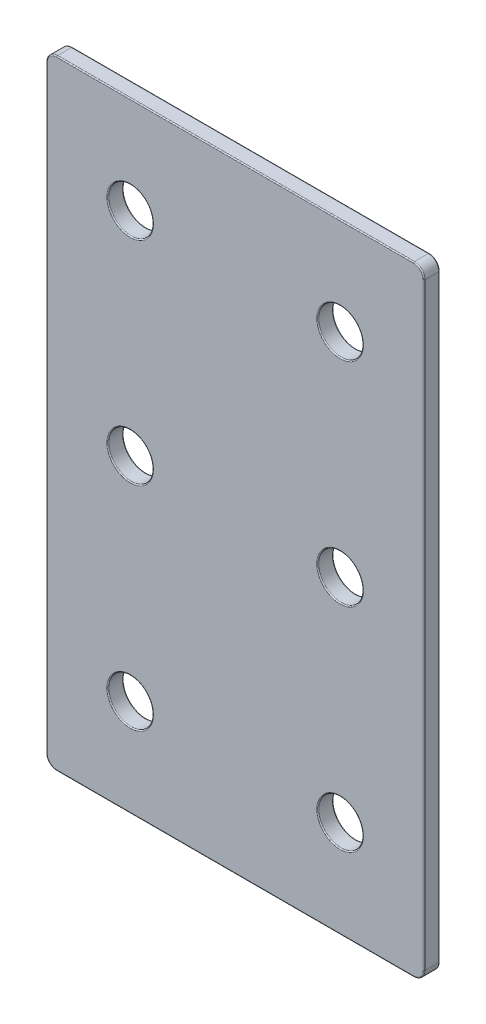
ISO-10303-21;
HEADER;
FILE_DESCRIPTION(('STEP AP214'),'2;1');
FILE_NAME('part.step','',(''),(''),'','','');
FILE_SCHEMA(('AUTOMOTIVE_DESIGN { 1 0 10303 214 1 1 1 1 }'));
ENDSEC;
DATA;
#1=APPLICATION_CONTEXT('core data for automotive mechanical design processes');
#2=APPLICATION_PROTOCOL_DEFINITION('international standard','automotive_design',2000,#1);
#3=PRODUCT_CONTEXT('',#1,'mechanical');
#4=PRODUCT('Part','Part','',(#3));
#5=PRODUCT_RELATED_PRODUCT_CATEGORY('part','',(#4));
#6=PRODUCT_DEFINITION_FORMATION('','',#4);
#7=PRODUCT_DEFINITION_CONTEXT('part definition',#1,'design');
#8=PRODUCT_DEFINITION('design','',#6,#7);
#9=PRODUCT_DEFINITION_SHAPE('','',#8);
#10=(LENGTH_UNIT() NAMED_UNIT(*) SI_UNIT(.MILLI.,.METRE.));
#11=(NAMED_UNIT(*) PLANE_ANGLE_UNIT() SI_UNIT($,.RADIAN.));
#12=(NAMED_UNIT(*) SI_UNIT($,.STERADIAN.) SOLID_ANGLE_UNIT());
#13=UNCERTAINTY_MEASURE_WITH_UNIT(LENGTH_MEASURE(1.E-05),#10,'distance_accuracy_value','');
#14=(GEOMETRIC_REPRESENTATION_CONTEXT(3) GLOBAL_UNCERTAINTY_ASSIGNED_CONTEXT((#13)) GLOBAL_UNIT_ASSIGNED_CONTEXT((#10,
#11,#12)) REPRESENTATION_CONTEXT('',''));
#15=CARTESIAN_POINT('',(0.,0.,0.));
#16=DIRECTION('',(0.,0.,1.));
#17=DIRECTION('',(1.,0.,0.));
#18=AXIS2_PLACEMENT_3D('',#15,#16,#17);
#19=CARTESIAN_POINT('',(36.,59.,1.5));
#20=DIRECTION('',(-1.,0.,0.));
#21=DIRECTION('',(0.,-1.,0.));
#22=AXIS2_PLACEMENT_3D('',#19,#20,#21);
#23=PLANE('',#22);
#24=DIRECTION('',(0.,0.,-1.));
#25=VECTOR('',#24,1.);
#26=CARTESIAN_POINT('',(36.,-57.,1.5));
#27=LINE('',#26,#25);
#28=CARTESIAN_POINT('',(36.,-57.,1.3));
#29=VERTEX_POINT('',#28);
#30=CARTESIAN_POINT('',(36.,-57.,-1.3));
#31=VERTEX_POINT('',#30);
#32=EDGE_CURVE('E336',#29,#31,#27,.T.);
#33=ORIENTED_EDGE('',*,*,#32,.T.);
#34=DIRECTION('',(0.,1.,0.));
#35=VECTOR('',#34,1.);
#36=CARTESIAN_POINT('',(36.,59.,-1.3));
#37=LINE('',#36,#35);
#38=CARTESIAN_POINT('',(36.,57.,-1.3));
#39=VERTEX_POINT('',#38);
#40=EDGE_CURVE('E187',#31,#39,#37,.T.);
#41=ORIENTED_EDGE('',*,*,#40,.T.);
#42=DIRECTION('',(0.,0.,-1.));
#43=VECTOR('',#42,1.);
#44=CARTESIAN_POINT('',(36.,57.,1.5));
#45=LINE('',#44,#43);
#46=CARTESIAN_POINT('',(36.,57.,1.3));
#47=VERTEX_POINT('',#46);
#48=EDGE_CURVE('E351',#39,#47,#45,.F.);
#49=ORIENTED_EDGE('',*,*,#48,.T.);
#50=DIRECTION('',(0.,1.,0.));
#51=VECTOR('',#50,1.);
#52=CARTESIAN_POINT('',(36.,-57.,1.3));
#53=LINE('',#52,#51);
#54=EDGE_CURVE('E185',#47,#29,#53,.F.);
#55=ORIENTED_EDGE('',*,*,#54,.T.);
#56=EDGE_LOOP('',(#33,#41,#49,#55));
#57=FACE_BOUND('',#56,.T.);
#58=ADVANCED_FACE('F37',(#57),#23,.F.);
#59=CARTESIAN_POINT('',(-36.,59.,1.5));
#60=DIRECTION('',(0.,-1.,0.));
#61=DIRECTION('',(0.,0.,-1.));
#62=AXIS2_PLACEMENT_3D('',#59,#60,#61);
#63=PLANE('',#62);
#64=DIRECTION('',(0.,0.,-1.));
#65=VECTOR('',#64,1.);
#66=CARTESIAN_POINT('',(34.,59.,1.5));
#67=LINE('',#66,#65);
#68=CARTESIAN_POINT('',(34.,59.,1.3));
#69=VERTEX_POINT('',#68);
#70=CARTESIAN_POINT('',(34.,59.,-1.3));
#71=VERTEX_POINT('',#70);
#72=EDGE_CURVE('E355',#69,#71,#67,.T.);
#73=ORIENTED_EDGE('',*,*,#72,.T.);
#74=DIRECTION('',(-1.,0.,0.));
#75=VECTOR('',#74,1.);
#76=CARTESIAN_POINT('',(-36.,59.,-1.3));
#77=LINE('',#76,#75);
#78=CARTESIAN_POINT('',(-34.,59.,-1.3));
#79=VERTEX_POINT('',#78);
#80=EDGE_CURVE('E195',#71,#79,#77,.T.);
#81=ORIENTED_EDGE('',*,*,#80,.T.);
#82=DIRECTION('',(0.,0.,-1.));
#83=VECTOR('',#82,1.);
#84=CARTESIAN_POINT('',(-34.,59.,1.5));
#85=LINE('',#84,#83);
#86=CARTESIAN_POINT('',(-34.,59.,1.3));
#87=VERTEX_POINT('',#86);
#88=EDGE_CURVE('E358',#79,#87,#85,.F.);
#89=ORIENTED_EDGE('',*,*,#88,.T.);
#90=DIRECTION('',(-1.,0.,0.));
#91=VECTOR('',#90,1.);
#92=CARTESIAN_POINT('',(34.,59.,1.3));
#93=LINE('',#92,#91);
#94=EDGE_CURVE('E193',#87,#69,#93,.F.);
#95=ORIENTED_EDGE('',*,*,#94,.T.);
#96=EDGE_LOOP('',(#73,#81,#89,#95));
#97=FACE_BOUND('',#96,.T.);
#98=ADVANCED_FACE('F440',(#97),#63,.F.);
#99=CARTESIAN_POINT('',(-36.,59.,1.5));
#100=DIRECTION('',(1.,0.,0.));
#101=DIRECTION('',(0.,1.,0.));
#102=AXIS2_PLACEMENT_3D('',#99,#100,#101);
#103=PLANE('',#102);
#104=DIRECTION('',(0.,0.,-1.));
#105=VECTOR('',#104,1.);
#106=CARTESIAN_POINT('',(-36.,57.,1.5));
#107=LINE('',#106,#105);
#108=CARTESIAN_POINT('',(-36.,57.,1.3));
#109=VERTEX_POINT('',#108);
#110=CARTESIAN_POINT('',(-36.,57.,-1.3));
#111=VERTEX_POINT('',#110);
#112=EDGE_CURVE('E343',#109,#111,#107,.T.);
#113=ORIENTED_EDGE('',*,*,#112,.T.);
#114=DIRECTION('',(0.,-1.,0.));
#115=VECTOR('',#114,1.);
#116=CARTESIAN_POINT('',(-36.,59.,-1.3));
#117=LINE('',#116,#115);
#118=CARTESIAN_POINT('',(-36.,-57.,-1.3));
#119=VERTEX_POINT('',#118);
#120=EDGE_CURVE('E204',#111,#119,#117,.T.);
#121=ORIENTED_EDGE('',*,*,#120,.T.);
#122=DIRECTION('',(0.,0.,-1.));
#123=VECTOR('',#122,1.);
#124=CARTESIAN_POINT('',(-36.,-57.,1.5));
#125=LINE('',#124,#123);
#126=CARTESIAN_POINT('',(-36.,-57.,1.3));
#127=VERTEX_POINT('',#126);
#128=EDGE_CURVE('E348',#119,#127,#125,.F.);
#129=ORIENTED_EDGE('',*,*,#128,.T.);
#130=DIRECTION('',(0.,-1.,0.));
#131=VECTOR('',#130,1.);
#132=CARTESIAN_POINT('',(-36.,57.,1.3));
#133=LINE('',#132,#131);
#134=EDGE_CURVE('E202',#127,#109,#133,.F.);
#135=ORIENTED_EDGE('',*,*,#134,.T.);
#136=EDGE_LOOP('',(#113,#121,#129,#135));
#137=FACE_BOUND('',#136,.T.);
#138=ADVANCED_FACE('F424',(#137),#103,.F.);
#139=CARTESIAN_POINT('',(-36.,-59.,1.5));
#140=DIRECTION('',(0.,1.,0.));
#141=DIRECTION('',(0.,0.,1.));
#142=AXIS2_PLACEMENT_3D('',#139,#140,#141);
#143=PLANE('',#142);
#144=DIRECTION('',(0.,0.,-1.));
#145=VECTOR('',#144,1.);
#146=CARTESIAN_POINT('',(-34.,-59.,1.5));
#147=LINE('',#146,#145);
#148=CARTESIAN_POINT('',(-34.,-59.,1.3));
#149=VERTEX_POINT('',#148);
#150=CARTESIAN_POINT('',(-34.,-59.,-1.3));
#151=VERTEX_POINT('',#150);
#152=EDGE_CURVE('E341',#149,#151,#147,.T.);
#153=ORIENTED_EDGE('',*,*,#152,.T.);
#154=DIRECTION('',(1.,0.,0.));
#155=VECTOR('',#154,1.);
#156=CARTESIAN_POINT('',(-36.,-59.,-1.3));
#157=LINE('',#156,#155);
#158=CARTESIAN_POINT('',(34.,-59.,-1.3));
#159=VERTEX_POINT('',#158);
#160=EDGE_CURVE('E212',#151,#159,#157,.T.);
#161=ORIENTED_EDGE('',*,*,#160,.T.);
#162=DIRECTION('',(0.,0.,-1.));
#163=VECTOR('',#162,1.);
#164=CARTESIAN_POINT('',(34.,-59.,1.5));
#165=LINE('',#164,#163);
#166=CARTESIAN_POINT('',(34.,-59.,1.3));
#167=VERTEX_POINT('',#166);
#168=EDGE_CURVE('E297',#159,#167,#165,.F.);
#169=ORIENTED_EDGE('',*,*,#168,.T.);
#170=DIRECTION('',(1.,0.,0.));
#171=VECTOR('',#170,1.);
#172=CARTESIAN_POINT('',(-34.,-59.,1.3));
#173=LINE('',#172,#171);
#174=EDGE_CURVE('E210',#167,#149,#173,.F.);
#175=ORIENTED_EDGE('',*,*,#174,.T.);
#176=EDGE_LOOP('',(#153,#161,#169,#175));
#177=FACE_BOUND('',#176,.T.);
#178=ADVANCED_FACE('F339',(#177),#143,.F.);
#179=CARTESIAN_POINT('',(0.,0.,1.5));
#180=DIRECTION('',(0.,0.,1.));
#181=DIRECTION('',(1.,0.,0.));
#182=AXIS2_PLACEMENT_3D('',#179,#180,#181);
#183=PLANE('',#182);
#184=DIRECTION('',(-1.,0.,0.));
#185=VECTOR('',#184,1.);
#186=CARTESIAN_POINT('',(-34.,58.8,1.5));
#187=LINE('',#186,#185);
#188=CARTESIAN_POINT('',(34.,58.8,1.5));
#189=VERTEX_POINT('',#188);
#190=CARTESIAN_POINT('',(-34.,58.8,1.5));
#191=VERTEX_POINT('',#190);
#192=EDGE_CURVE('E46',#189,#191,#187,.T.);
#193=ORIENTED_EDGE('',*,*,#192,.T.);
#194=CARTESIAN_POINT('',(-34.,57.,1.5));
#195=DIRECTION('',(0.,0.,1.));
#196=DIRECTION('',(1.,0.,0.));
#197=AXIS2_PLACEMENT_3D('',#194,#195,#196);
#198=CIRCLE('',#197,1.8);
#199=CARTESIAN_POINT('',(-35.8,57.,1.5));
#200=VERTEX_POINT('',#199);
#201=EDGE_CURVE('E11',#191,#200,#198,.T.);
#202=ORIENTED_EDGE('',*,*,#201,.T.);
#203=DIRECTION('',(0.,-1.,0.));
#204=VECTOR('',#203,1.);
#205=CARTESIAN_POINT('',(-35.8,-57.,1.5));
#206=LINE('',#205,#204);
#207=CARTESIAN_POINT('',(-35.8,-57.,1.5));
#208=VERTEX_POINT('',#207);
#209=EDGE_CURVE('E268',#200,#208,#206,.T.);
#210=ORIENTED_EDGE('',*,*,#209,.T.);
#211=CARTESIAN_POINT('',(-34.,-57.,1.5));
#212=DIRECTION('',(0.,0.,1.));
#213=DIRECTION('',(1.,0.,0.));
#214=AXIS2_PLACEMENT_3D('',#211,#212,#213);
#215=CIRCLE('',#214,1.8);
#216=CARTESIAN_POINT('',(-34.,-58.8,1.5));
#217=VERTEX_POINT('',#216);
#218=EDGE_CURVE('E270',#208,#217,#215,.T.);
#219=ORIENTED_EDGE('',*,*,#218,.T.);
#220=DIRECTION('',(1.,0.,0.));
#221=VECTOR('',#220,1.);
#222=CARTESIAN_POINT('',(34.,-58.8,1.5));
#223=LINE('',#222,#221);
#224=CARTESIAN_POINT('',(34.,-58.8,1.5));
#225=VERTEX_POINT('',#224);
#226=EDGE_CURVE('E272',#217,#225,#223,.T.);
#227=ORIENTED_EDGE('',*,*,#226,.T.);
#228=CARTESIAN_POINT('',(34.,-57.,1.5));
#229=DIRECTION('',(0.,0.,1.));
#230=DIRECTION('',(1.,0.,0.));
#231=AXIS2_PLACEMENT_3D('',#228,#229,#230);
#232=CIRCLE('',#231,1.8);
#233=CARTESIAN_POINT('',(35.8,-57.,1.5));
#234=VERTEX_POINT('',#233);
#235=EDGE_CURVE('E274',#225,#234,#232,.T.);
#236=ORIENTED_EDGE('',*,*,#235,.T.);
#237=DIRECTION('',(0.,1.,0.));
#238=VECTOR('',#237,1.);
#239=CARTESIAN_POINT('',(35.8,57.,1.5));
#240=LINE('',#239,#238);
#241=CARTESIAN_POINT('',(35.8,57.,1.5));
#242=VERTEX_POINT('',#241);
#243=EDGE_CURVE('E276',#234,#242,#240,.T.);
#244=ORIENTED_EDGE('',*,*,#243,.T.);
#245=CARTESIAN_POINT('',(34.,57.,1.5));
#246=DIRECTION('',(0.,0.,1.));
#247=DIRECTION('',(1.,0.,0.));
#248=AXIS2_PLACEMENT_3D('',#245,#246,#247);
#249=CIRCLE('',#248,1.8);
#250=EDGE_CURVE('E57',#242,#189,#249,.T.);
#251=ORIENTED_EDGE('',*,*,#250,.T.);
#252=EDGE_LOOP('',(#193,#202,#210,#219,#227,#236,#244,#251));
#253=FACE_BOUND('',#252,.T.);
#254=CARTESIAN_POINT('',(20.,0.,1.5));
#255=DIRECTION('',(0.,0.,1.));
#256=DIRECTION('',(1.,0.,0.));
#257=AXIS2_PLACEMENT_3D('',#254,#255,#256);
#258=CIRCLE('',#257,4.45);
#259=CARTESIAN_POINT('',(24.45,0.,1.5));
#260=VERTEX_POINT('',#259);
#261=EDGE_CURVE('E265',#260,#260,#258,.F.);
#262=ORIENTED_EDGE('',*,*,#261,.T.);
#263=EDGE_LOOP('',(#262));
#264=FACE_BOUND('',#263,.T.);
#265=CARTESIAN_POINT('',(20.,40.5,1.5));
#266=DIRECTION('',(0.,0.,1.));
#267=DIRECTION('',(1.,0.,0.));
#268=AXIS2_PLACEMENT_3D('',#265,#266,#267);
#269=CIRCLE('',#268,4.45);
#270=CARTESIAN_POINT('',(24.45,40.5,1.5));
#271=VERTEX_POINT('',#270);
#272=EDGE_CURVE('E262',#271,#271,#269,.F.);
#273=ORIENTED_EDGE('',*,*,#272,.T.);
#274=EDGE_LOOP('',(#273));
#275=FACE_BOUND('',#274,.T.);
#276=CARTESIAN_POINT('',(20.,-40.5,1.5));
#277=DIRECTION('',(0.,0.,1.));
#278=DIRECTION('',(1.,0.,0.));
#279=AXIS2_PLACEMENT_3D('',#276,#277,#278);
#280=CIRCLE('',#279,4.45);
#281=CARTESIAN_POINT('',(24.45,-40.5,1.5));
#282=VERTEX_POINT('',#281);
#283=EDGE_CURVE('E259',#282,#282,#280,.F.);
#284=ORIENTED_EDGE('',*,*,#283,.T.);
#285=EDGE_LOOP('',(#284));
#286=FACE_BOUND('',#285,.T.);
#287=CARTESIAN_POINT('',(-20.,-40.5,1.5));
#288=DIRECTION('',(0.,0.,1.));
#289=DIRECTION('',(1.,0.,0.));
#290=AXIS2_PLACEMENT_3D('',#287,#288,#289);
#291=CIRCLE('',#290,4.45);
#292=CARTESIAN_POINT('',(-15.55,-40.5,1.5));
#293=VERTEX_POINT('',#292);
#294=EDGE_CURVE('E256',#293,#293,#291,.F.);
#295=ORIENTED_EDGE('',*,*,#294,.T.);
#296=EDGE_LOOP('',(#295));
#297=FACE_BOUND('',#296,.T.);
#298=CARTESIAN_POINT('',(-20.,0.,1.5));
#299=DIRECTION('',(0.,0.,1.));
#300=DIRECTION('',(1.,0.,0.));
#301=AXIS2_PLACEMENT_3D('',#298,#299,#300);
#302=CIRCLE('',#301,4.45);
#303=CARTESIAN_POINT('',(-15.55,0.,1.5));
#304=VERTEX_POINT('',#303);
#305=EDGE_CURVE('E253',#304,#304,#302,.F.);
#306=ORIENTED_EDGE('',*,*,#305,.T.);
#307=EDGE_LOOP('',(#306));
#308=FACE_BOUND('',#307,.T.);
#309=CARTESIAN_POINT('',(-20.,40.5,1.5));
#310=DIRECTION('',(0.,0.,1.));
#311=DIRECTION('',(1.,0.,0.));
#312=AXIS2_PLACEMENT_3D('',#309,#310,#311);
#313=CIRCLE('',#312,4.45);
#314=CARTESIAN_POINT('',(-15.55,40.5,1.5));
#315=VERTEX_POINT('',#314);
#316=EDGE_CURVE('E250',#315,#315,#313,.F.);
#317=ORIENTED_EDGE('',*,*,#316,.T.);
#318=EDGE_LOOP('',(#317));
#319=FACE_BOUND('',#318,.T.);
#320=ADVANCED_FACE('F411',(#253,#264,#275,#286,#297,#308,#319),#183,.T.);
#321=CARTESIAN_POINT('',(0.,0.,-1.5));
#322=DIRECTION('',(0.,0.,1.));
#323=DIRECTION('',(1.,0.,0.));
#324=AXIS2_PLACEMENT_3D('',#321,#322,#323);
#325=PLANE('',#324);
#326=DIRECTION('',(0.,1.,0.));
#327=VECTOR('',#326,1.);
#328=CARTESIAN_POINT('',(35.8,0.,-1.5));
#329=LINE('',#328,#327);
#330=CARTESIAN_POINT('',(35.8,57.,-1.5));
#331=VERTEX_POINT('',#330);
#332=CARTESIAN_POINT('',(35.8,-57.,-1.5));
#333=VERTEX_POINT('',#332);
#334=EDGE_CURVE('E175',#331,#333,#329,.F.);
#335=ORIENTED_EDGE('',*,*,#334,.T.);
#336=CARTESIAN_POINT('',(34.,-57.,-1.5));
#337=DIRECTION('',(0.,0.,1.));
#338=DIRECTION('',(1.,0.,0.));
#339=AXIS2_PLACEMENT_3D('',#336,#337,#338);
#340=CIRCLE('',#339,1.8);
#341=CARTESIAN_POINT('',(34.,-58.8,-1.5));
#342=VERTEX_POINT('',#341);
#343=EDGE_CURVE('E155',#333,#342,#340,.F.);
#344=ORIENTED_EDGE('',*,*,#343,.T.);
#345=DIRECTION('',(1.,0.,0.));
#346=VECTOR('',#345,1.);
#347=CARTESIAN_POINT('',(0.,-58.8,-1.5));
#348=LINE('',#347,#346);
#349=CARTESIAN_POINT('',(-34.,-58.8,-1.5));
#350=VERTEX_POINT('',#349);
#351=EDGE_CURVE('E163',#342,#350,#348,.F.);
#352=ORIENTED_EDGE('',*,*,#351,.T.);
#353=CARTESIAN_POINT('',(-34.,-57.,-1.5));
#354=DIRECTION('',(0.,0.,1.));
#355=DIRECTION('',(1.,0.,0.));
#356=AXIS2_PLACEMENT_3D('',#353,#354,#355);
#357=CIRCLE('',#356,1.8);
#358=CARTESIAN_POINT('',(-35.8,-57.,-1.5));
#359=VERTEX_POINT('',#358);
#360=EDGE_CURVE('E169',#350,#359,#357,.F.);
#361=ORIENTED_EDGE('',*,*,#360,.T.);
#362=DIRECTION('',(0.,-1.,0.));
#363=VECTOR('',#362,1.);
#364=CARTESIAN_POINT('',(-35.8,0.,-1.5));
#365=LINE('',#364,#363);
#366=CARTESIAN_POINT('',(-35.8,57.,-1.5));
#367=VERTEX_POINT('',#366);
#368=EDGE_CURVE('E379',#359,#367,#365,.F.);
#369=ORIENTED_EDGE('',*,*,#368,.T.);
#370=CARTESIAN_POINT('',(-34.,57.,-1.5));
#371=DIRECTION('',(0.,0.,1.));
#372=DIRECTION('',(1.,0.,0.));
#373=AXIS2_PLACEMENT_3D('',#370,#371,#372);
#374=CIRCLE('',#373,1.8);
#375=CARTESIAN_POINT('',(-34.,58.8,-1.5));
#376=VERTEX_POINT('',#375);
#377=EDGE_CURVE('E381',#367,#376,#374,.F.);
#378=ORIENTED_EDGE('',*,*,#377,.T.);
#379=DIRECTION('',(-1.,0.,0.));
#380=VECTOR('',#379,1.);
#381=CARTESIAN_POINT('',(0.,58.8,-1.5));
#382=LINE('',#381,#380);
#383=CARTESIAN_POINT('',(34.,58.8,-1.5));
#384=VERTEX_POINT('',#383);
#385=EDGE_CURVE('E383',#376,#384,#382,.F.);
#386=ORIENTED_EDGE('',*,*,#385,.T.);
#387=CARTESIAN_POINT('',(34.,57.,-1.5));
#388=DIRECTION('',(0.,0.,1.));
#389=DIRECTION('',(1.,0.,0.));
#390=AXIS2_PLACEMENT_3D('',#387,#388,#389);
#391=CIRCLE('',#390,1.8);
#392=EDGE_CURVE('E180',#384,#331,#391,.F.);
#393=ORIENTED_EDGE('',*,*,#392,.T.);
#394=EDGE_LOOP('',(#335,#344,#352,#361,#369,#378,#386,#393));
#395=FACE_BOUND('',#394,.T.);
#396=CARTESIAN_POINT('',(20.,0.,-1.5));
#397=DIRECTION('',(0.,0.,1.));
#398=DIRECTION('',(1.,0.,0.));
#399=AXIS2_PLACEMENT_3D('',#396,#397,#398);
#400=CIRCLE('',#399,4.45);
#401=CARTESIAN_POINT('',(24.45,0.,-1.5));
#402=VERTEX_POINT('',#401);
#403=EDGE_CURVE('E170',#402,#402,#400,.T.);
#404=ORIENTED_EDGE('',*,*,#403,.T.);
#405=EDGE_LOOP('',(#404));
#406=FACE_BOUND('',#405,.T.);
#407=CARTESIAN_POINT('',(20.,40.5,-1.5));
#408=DIRECTION('',(0.,0.,1.));
#409=DIRECTION('',(1.,0.,0.));
#410=AXIS2_PLACEMENT_3D('',#407,#408,#409);
#411=CIRCLE('',#410,4.45);
#412=CARTESIAN_POINT('',(24.45,40.5,-1.5));
#413=VERTEX_POINT('',#412);
#414=EDGE_CURVE('E373',#413,#413,#411,.T.);
#415=ORIENTED_EDGE('',*,*,#414,.T.);
#416=EDGE_LOOP('',(#415));
#417=FACE_BOUND('',#416,.T.);
#418=CARTESIAN_POINT('',(20.,-40.5,-1.5));
#419=DIRECTION('',(0.,0.,1.));
#420=DIRECTION('',(1.,0.,0.));
#421=AXIS2_PLACEMENT_3D('',#418,#419,#420);
#422=CIRCLE('',#421,4.45);
#423=CARTESIAN_POINT('',(24.45,-40.5,-1.5));
#424=VERTEX_POINT('',#423);
#425=EDGE_CURVE('E370',#424,#424,#422,.T.);
#426=ORIENTED_EDGE('',*,*,#425,.T.);
#427=EDGE_LOOP('',(#426));
#428=FACE_BOUND('',#427,.T.);
#429=CARTESIAN_POINT('',(-20.,-40.5,-1.5));
#430=DIRECTION('',(0.,0.,1.));
#431=DIRECTION('',(1.,0.,0.));
#432=AXIS2_PLACEMENT_3D('',#429,#430,#431);
#433=CIRCLE('',#432,4.45);
#434=CARTESIAN_POINT('',(-15.55,-40.5,-1.5));
#435=VERTEX_POINT('',#434);
#436=EDGE_CURVE('E367',#435,#435,#433,.T.);
#437=ORIENTED_EDGE('',*,*,#436,.T.);
#438=EDGE_LOOP('',(#437));
#439=FACE_BOUND('',#438,.T.);
#440=CARTESIAN_POINT('',(-20.,0.,-1.5));
#441=DIRECTION('',(0.,0.,1.));
#442=DIRECTION('',(1.,0.,0.));
#443=AXIS2_PLACEMENT_3D('',#440,#441,#442);
#444=CIRCLE('',#443,4.45);
#445=CARTESIAN_POINT('',(-15.55,0.,-1.5));
#446=VERTEX_POINT('',#445);
#447=EDGE_CURVE('E364',#446,#446,#444,.T.);
#448=ORIENTED_EDGE('',*,*,#447,.T.);
#449=EDGE_LOOP('',(#448));
#450=FACE_BOUND('',#449,.T.);
#451=CARTESIAN_POINT('',(-20.,40.5,-1.5));
#452=DIRECTION('',(0.,0.,1.));
#453=DIRECTION('',(1.,0.,0.));
#454=AXIS2_PLACEMENT_3D('',#451,#452,#453);
#455=CIRCLE('',#454,4.45);
#456=CARTESIAN_POINT('',(-15.55,40.5,-1.5));
#457=VERTEX_POINT('',#456);
#458=EDGE_CURVE('E361',#457,#457,#455,.T.);
#459=ORIENTED_EDGE('',*,*,#458,.T.);
#460=EDGE_LOOP('',(#459));
#461=FACE_BOUND('',#460,.T.);
#462=ADVANCED_FACE('F172',(#395,#406,#417,#428,#439,#450,#461),#325,.F.);
#463=CARTESIAN_POINT('',(20.,0.,-1.5));
#464=DIRECTION('',(0.,0.,1.));
#465=DIRECTION('',(1.,0.,0.));
#466=AXIS2_PLACEMENT_3D('',#463,#464,#465);
#467=CYLINDRICAL_SURFACE('',#466,4.25);
#468=CARTESIAN_POINT('',(20.,0.,-1.3));
#469=DIRECTION('',(0.,0.,1.));
#470=DIRECTION('',(1.,0.,0.));
#471=AXIS2_PLACEMENT_3D('',#468,#469,#470);
#472=CIRCLE('',#471,4.25);
#473=CARTESIAN_POINT('',(24.25,0.,-1.3));
#474=VERTEX_POINT('',#473);
#475=EDGE_CURVE('E217',#474,#474,#472,.F.);
#476=ORIENTED_EDGE('',*,*,#475,.T.);
#477=EDGE_LOOP('',(#476));
#478=FACE_BOUND('',#477,.T.);
#479=CARTESIAN_POINT('',(20.,0.,1.3));
#480=DIRECTION('',(0.,0.,1.));
#481=DIRECTION('',(1.,0.,0.));
#482=AXIS2_PLACEMENT_3D('',#479,#480,#481);
#483=CIRCLE('',#482,4.25);
#484=CARTESIAN_POINT('',(24.25,0.,1.3));
#485=VERTEX_POINT('',#484);
#486=EDGE_CURVE('E214',#485,#485,#483,.T.);
#487=ORIENTED_EDGE('',*,*,#486,.T.);
#488=EDGE_LOOP('',(#487));
#489=FACE_BOUND('',#488,.T.);
#490=ADVANCED_FACE('F570',(#478,#489),#467,.F.);
#491=CARTESIAN_POINT('',(20.,40.5,-1.5));
#492=DIRECTION('',(0.,0.,1.));
#493=DIRECTION('',(1.,0.,0.));
#494=AXIS2_PLACEMENT_3D('',#491,#492,#493);
#495=CYLINDRICAL_SURFACE('',#494,4.25);
#496=CARTESIAN_POINT('',(20.,40.5,-1.3));
#497=DIRECTION('',(0.,0.,1.));
#498=DIRECTION('',(1.,0.,0.));
#499=AXIS2_PLACEMENT_3D('',#496,#497,#498);
#500=CIRCLE('',#499,4.25);
#501=CARTESIAN_POINT('',(24.25,40.5,-1.3));
#502=VERTEX_POINT('',#501);
#503=EDGE_CURVE('E223',#502,#502,#500,.F.);
#504=ORIENTED_EDGE('',*,*,#503,.T.);
#505=EDGE_LOOP('',(#504));
#506=FACE_BOUND('',#505,.T.);
#507=CARTESIAN_POINT('',(20.,40.5,1.3));
#508=DIRECTION('',(0.,0.,1.));
#509=DIRECTION('',(1.,0.,0.));
#510=AXIS2_PLACEMENT_3D('',#507,#508,#509);
#511=CIRCLE('',#510,4.25);
#512=CARTESIAN_POINT('',(24.25,40.5,1.3));
#513=VERTEX_POINT('',#512);
#514=EDGE_CURVE('E220',#513,#513,#511,.T.);
#515=ORIENTED_EDGE('',*,*,#514,.T.);
#516=EDGE_LOOP('',(#515));
#517=FACE_BOUND('',#516,.T.);
#518=ADVANCED_FACE('F566',(#506,#517),#495,.F.);
#519=CARTESIAN_POINT('',(20.,-40.5,-1.5));
#520=DIRECTION('',(0.,0.,1.));
#521=DIRECTION('',(1.,0.,0.));
#522=AXIS2_PLACEMENT_3D('',#519,#520,#521);
#523=CYLINDRICAL_SURFACE('',#522,4.25);
#524=CARTESIAN_POINT('',(20.,-40.5,-1.3));
#525=DIRECTION('',(0.,0.,1.));
#526=DIRECTION('',(1.,0.,0.));
#527=AXIS2_PLACEMENT_3D('',#524,#525,#526);
#528=CIRCLE('',#527,4.25);
#529=CARTESIAN_POINT('',(24.25,-40.5,-1.3));
#530=VERTEX_POINT('',#529);
#531=EDGE_CURVE('E229',#530,#530,#528,.F.);
#532=ORIENTED_EDGE('',*,*,#531,.T.);
#533=EDGE_LOOP('',(#532));
#534=FACE_BOUND('',#533,.T.);
#535=CARTESIAN_POINT('',(20.,-40.5,1.3));
#536=DIRECTION('',(0.,0.,1.));
#537=DIRECTION('',(1.,0.,0.));
#538=AXIS2_PLACEMENT_3D('',#535,#536,#537);
#539=CIRCLE('',#538,4.25);
#540=CARTESIAN_POINT('',(24.25,-40.5,1.3));
#541=VERTEX_POINT('',#540);
#542=EDGE_CURVE('E226',#541,#541,#539,.T.);
#543=ORIENTED_EDGE('',*,*,#542,.T.);
#544=EDGE_LOOP('',(#543));
#545=FACE_BOUND('',#544,.T.);
#546=ADVANCED_FACE('F560',(#534,#545),#523,.F.);
#547=CARTESIAN_POINT('',(-20.,-40.5,-1.5));
#548=DIRECTION('',(0.,0.,1.));
#549=DIRECTION('',(1.,0.,0.));
#550=AXIS2_PLACEMENT_3D('',#547,#548,#549);
#551=CYLINDRICAL_SURFACE('',#550,4.25);
#552=CARTESIAN_POINT('',(-20.,-40.5,-1.3));
#553=DIRECTION('',(0.,0.,1.));
#554=DIRECTION('',(1.,0.,0.));
#555=AXIS2_PLACEMENT_3D('',#552,#553,#554);
#556=CIRCLE('',#555,4.25);
#557=CARTESIAN_POINT('',(-15.75,-40.5,-1.3));
#558=VERTEX_POINT('',#557);
#559=EDGE_CURVE('E235',#558,#558,#556,.F.);
#560=ORIENTED_EDGE('',*,*,#559,.T.);
#561=EDGE_LOOP('',(#560));
#562=FACE_BOUND('',#561,.T.);
#563=CARTESIAN_POINT('',(-20.,-40.5,1.3));
#564=DIRECTION('',(0.,0.,1.));
#565=DIRECTION('',(1.,0.,0.));
#566=AXIS2_PLACEMENT_3D('',#563,#564,#565);
#567=CIRCLE('',#566,4.25);
#568=CARTESIAN_POINT('',(-15.75,-40.5,1.3));
#569=VERTEX_POINT('',#568);
#570=EDGE_CURVE('E232',#569,#569,#567,.T.);
#571=ORIENTED_EDGE('',*,*,#570,.T.);
#572=EDGE_LOOP('',(#571));
#573=FACE_BOUND('',#572,.T.);
#574=ADVANCED_FACE('F551',(#562,#573),#551,.F.);
#575=CARTESIAN_POINT('',(-20.,0.,-1.5));
#576=DIRECTION('',(0.,0.,1.));
#577=DIRECTION('',(1.,0.,0.));
#578=AXIS2_PLACEMENT_3D('',#575,#576,#577);
#579=CYLINDRICAL_SURFACE('',#578,4.25);
#580=CARTESIAN_POINT('',(-20.,0.,-1.3));
#581=DIRECTION('',(0.,0.,1.));
#582=DIRECTION('',(1.,0.,0.));
#583=AXIS2_PLACEMENT_3D('',#580,#581,#582);
#584=CIRCLE('',#583,4.25);
#585=CARTESIAN_POINT('',(-15.75,0.,-1.3));
#586=VERTEX_POINT('',#585);
#587=EDGE_CURVE('E241',#586,#586,#584,.F.);
#588=ORIENTED_EDGE('',*,*,#587,.T.);
#589=EDGE_LOOP('',(#588));
#590=FACE_BOUND('',#589,.T.);
#591=CARTESIAN_POINT('',(-20.,0.,1.3));
#592=DIRECTION('',(0.,0.,1.));
#593=DIRECTION('',(1.,0.,0.));
#594=AXIS2_PLACEMENT_3D('',#591,#592,#593);
#595=CIRCLE('',#594,4.25);
#596=CARTESIAN_POINT('',(-15.75,0.,1.3));
#597=VERTEX_POINT('',#596);
#598=EDGE_CURVE('E238',#597,#597,#595,.T.);
#599=ORIENTED_EDGE('',*,*,#598,.T.);
#600=EDGE_LOOP('',(#599));
#601=FACE_BOUND('',#600,.T.);
#602=ADVANCED_FACE('F549',(#590,#601),#579,.F.);
#603=CARTESIAN_POINT('',(-20.,40.5,-1.5));
#604=DIRECTION('',(0.,0.,1.));
#605=DIRECTION('',(1.,0.,0.));
#606=AXIS2_PLACEMENT_3D('',#603,#604,#605);
#607=CYLINDRICAL_SURFACE('',#606,4.25);
#608=CARTESIAN_POINT('',(-20.,40.5,-1.3));
#609=DIRECTION('',(0.,0.,1.));
#610=DIRECTION('',(1.,0.,0.));
#611=AXIS2_PLACEMENT_3D('',#608,#609,#610);
#612=CIRCLE('',#611,4.25);
#613=CARTESIAN_POINT('',(-15.75,40.5,-1.3));
#614=VERTEX_POINT('',#613);
#615=EDGE_CURVE('E247',#614,#614,#612,.F.);
#616=ORIENTED_EDGE('',*,*,#615,.T.);
#617=EDGE_LOOP('',(#616));
#618=FACE_BOUND('',#617,.T.);
#619=CARTESIAN_POINT('',(-20.,40.5,1.3));
#620=DIRECTION('',(0.,0.,1.));
#621=DIRECTION('',(1.,0.,0.));
#622=AXIS2_PLACEMENT_3D('',#619,#620,#621);
#623=CIRCLE('',#622,4.25);
#624=CARTESIAN_POINT('',(-15.75,40.5,1.3));
#625=VERTEX_POINT('',#624);
#626=EDGE_CURVE('E244',#625,#625,#623,.T.);
#627=ORIENTED_EDGE('',*,*,#626,.T.);
#628=EDGE_LOOP('',(#627));
#629=FACE_BOUND('',#628,.T.);
#630=ADVANCED_FACE('F454',(#618,#629),#607,.F.);
#631=CARTESIAN_POINT('',(-34.,-57.,1.5));
#632=DIRECTION('',(0.,0.,-1.));
#633=DIRECTION('',(-1.,0.,0.));
#634=AXIS2_PLACEMENT_3D('',#631,#632,#633);
#635=CYLINDRICAL_SURFACE('',#634,2.);
#636=ORIENTED_EDGE('',*,*,#128,.F.);
#637=CARTESIAN_POINT('',(-34.,-57.,-1.3));
#638=DIRECTION('',(0.,0.,1.));
#639=DIRECTION('',(1.,0.,0.));
#640=AXIS2_PLACEMENT_3D('',#637,#638,#639);
#641=CIRCLE('',#640,2.);
#642=EDGE_CURVE('E208',#119,#151,#641,.T.);
#643=ORIENTED_EDGE('',*,*,#642,.T.);
#644=ORIENTED_EDGE('',*,*,#152,.F.);
#645=CARTESIAN_POINT('',(-34.,-57.,1.3));
#646=DIRECTION('',(0.,0.,1.));
#647=DIRECTION('',(1.,0.,0.));
#648=AXIS2_PLACEMENT_3D('',#645,#646,#647);
#649=CIRCLE('',#648,2.);
#650=EDGE_CURVE('E206',#149,#127,#649,.F.);
#651=ORIENTED_EDGE('',*,*,#650,.T.);
#652=EDGE_LOOP('',(#636,#643,#644,#651));
#653=FACE_BOUND('',#652,.T.);
#654=ADVANCED_FACE('F451',(#653),#635,.T.);
#655=CARTESIAN_POINT('',(34.,-57.,1.5));
#656=DIRECTION('',(0.,0.,-1.));
#657=DIRECTION('',(-1.,0.,0.));
#658=AXIS2_PLACEMENT_3D('',#655,#656,#657);
#659=CYLINDRICAL_SURFACE('',#658,2.);
#660=ORIENTED_EDGE('',*,*,#168,.F.);
#661=CARTESIAN_POINT('',(34.,-57.,-1.3));
#662=DIRECTION('',(0.,0.,1.));
#663=DIRECTION('',(1.,0.,0.));
#664=AXIS2_PLACEMENT_3D('',#661,#662,#663);
#665=CIRCLE('',#664,2.);
#666=EDGE_CURVE('E157',#159,#31,#665,.T.);
#667=ORIENTED_EDGE('',*,*,#666,.T.);
#668=ORIENTED_EDGE('',*,*,#32,.F.);
#669=CARTESIAN_POINT('',(34.,-57.,1.3));
#670=DIRECTION('',(0.,0.,1.));
#671=DIRECTION('',(1.,0.,0.));
#672=AXIS2_PLACEMENT_3D('',#669,#670,#671);
#673=CIRCLE('',#672,2.);
#674=EDGE_CURVE('E177',#29,#167,#673,.F.);
#675=ORIENTED_EDGE('',*,*,#674,.T.);
#676=EDGE_LOOP('',(#660,#667,#668,#675));
#677=FACE_BOUND('',#676,.T.);
#678=ADVANCED_FACE('F334',(#677),#659,.T.);
#679=CARTESIAN_POINT('',(-34.,57.,1.5));
#680=DIRECTION('',(0.,0.,-1.));
#681=DIRECTION('',(-1.,0.,0.));
#682=AXIS2_PLACEMENT_3D('',#679,#680,#681);
#683=CYLINDRICAL_SURFACE('',#682,2.);
#684=ORIENTED_EDGE('',*,*,#88,.F.);
#685=CARTESIAN_POINT('',(-34.,57.,-1.3));
#686=DIRECTION('',(0.,0.,1.));
#687=DIRECTION('',(1.,0.,0.));
#688=AXIS2_PLACEMENT_3D('',#685,#686,#687);
#689=CIRCLE('',#688,2.);
#690=EDGE_CURVE('E200',#79,#111,#689,.T.);
#691=ORIENTED_EDGE('',*,*,#690,.T.);
#692=ORIENTED_EDGE('',*,*,#112,.F.);
#693=CARTESIAN_POINT('',(-34.,57.,1.3));
#694=DIRECTION('',(0.,0.,1.));
#695=DIRECTION('',(1.,0.,0.));
#696=AXIS2_PLACEMENT_3D('',#693,#694,#695);
#697=CIRCLE('',#696,2.);
#698=EDGE_CURVE('E197',#109,#87,#697,.F.);
#699=ORIENTED_EDGE('',*,*,#698,.T.);
#700=EDGE_LOOP('',(#684,#691,#692,#699));
#701=FACE_BOUND('',#700,.T.);
#702=ADVANCED_FACE('F429',(#701),#683,.T.);
#703=CARTESIAN_POINT('',(34.,57.,1.5));
#704=DIRECTION('',(0.,0.,-1.));
#705=DIRECTION('',(-1.,0.,0.));
#706=AXIS2_PLACEMENT_3D('',#703,#704,#705);
#707=CYLINDRICAL_SURFACE('',#706,2.);
#708=ORIENTED_EDGE('',*,*,#48,.F.);
#709=CARTESIAN_POINT('',(34.,57.,-1.3));
#710=DIRECTION('',(0.,0.,1.));
#711=DIRECTION('',(1.,0.,0.));
#712=AXIS2_PLACEMENT_3D('',#709,#710,#711);
#713=CIRCLE('',#712,2.);
#714=EDGE_CURVE('E191',#39,#71,#713,.T.);
#715=ORIENTED_EDGE('',*,*,#714,.T.);
#716=ORIENTED_EDGE('',*,*,#72,.F.);
#717=CARTESIAN_POINT('',(34.,57.,1.3));
#718=DIRECTION('',(0.,0.,1.));
#719=DIRECTION('',(1.,0.,0.));
#720=AXIS2_PLACEMENT_3D('',#717,#718,#719);
#721=CIRCLE('',#720,2.);
#722=EDGE_CURVE('E189',#69,#47,#721,.F.);
#723=ORIENTED_EDGE('',*,*,#722,.T.);
#724=EDGE_LOOP('',(#708,#715,#716,#723));
#725=FACE_BOUND('',#724,.T.);
#726=ADVANCED_FACE('F397',(#725),#707,.T.);
#727=CARTESIAN_POINT('',(-34.,57.,-1.3));
#728=DIRECTION('',(0.,0.,1.));
#729=DIRECTION('',(1.,0.,0.));
#730=AXIS2_PLACEMENT_3D('',#727,#728,#729);
#731=TOROIDAL_SURFACE('',#730,1.8,0.2);
#732=CARTESIAN_POINT('',(-35.8,57.,-1.3));
#733=DIRECTION('',(0.,-1.,0.));
#734=DIRECTION('',(0.,0.,-1.));
#735=AXIS2_PLACEMENT_3D('',#732,#733,#734);
#736=CIRCLE('',#735,0.2);
#737=EDGE_CURVE('E291',#111,#367,#736,.T.);
#738=ORIENTED_EDGE('',*,*,#737,.F.);
#739=ORIENTED_EDGE('',*,*,#690,.F.);
#740=CARTESIAN_POINT('',(-34.,58.8,-1.3));
#741=DIRECTION('',(1.,0.,0.));
#742=DIRECTION('',(0.,0.,-1.));
#743=AXIS2_PLACEMENT_3D('',#740,#741,#742);
#744=CIRCLE('',#743,0.2);
#745=EDGE_CURVE('E294',#376,#79,#744,.T.);
#746=ORIENTED_EDGE('',*,*,#745,.F.);
#747=ORIENTED_EDGE('',*,*,#377,.F.);
#748=EDGE_LOOP('',(#738,#739,#746,#747));
#749=FACE_BOUND('',#748,.T.);
#750=ADVANCED_FACE('F433',(#749),#731,.T.);
#751=CARTESIAN_POINT('',(-36.,58.8,-1.3));
#752=DIRECTION('',(-1.,0.,0.));
#753=DIRECTION('',(0.,0.,1.));
#754=AXIS2_PLACEMENT_3D('',#751,#752,#753);
#755=CYLINDRICAL_SURFACE('',#754,0.2);
#756=ORIENTED_EDGE('',*,*,#745,.T.);
#757=ORIENTED_EDGE('',*,*,#80,.F.);
#758=CARTESIAN_POINT('',(34.,58.8,-1.3));
#759=DIRECTION('',(1.,0.,0.));
#760=DIRECTION('',(0.,0.,-1.));
#761=AXIS2_PLACEMENT_3D('',#758,#759,#760);
#762=CIRCLE('',#761,0.2);
#763=EDGE_CURVE('E288',#384,#71,#762,.T.);
#764=ORIENTED_EDGE('',*,*,#763,.F.);
#765=ORIENTED_EDGE('',*,*,#385,.F.);
#766=EDGE_LOOP('',(#756,#757,#764,#765));
#767=FACE_BOUND('',#766,.T.);
#768=ADVANCED_FACE('F438',(#767),#755,.T.);
#769=CARTESIAN_POINT('',(-35.8,59.,-1.3));
#770=DIRECTION('',(0.,-1.,0.));
#771=DIRECTION('',(1.,0.,0.));
#772=AXIS2_PLACEMENT_3D('',#769,#770,#771);
#773=CYLINDRICAL_SURFACE('',#772,0.2);
#774=ORIENTED_EDGE('',*,*,#737,.T.);
#775=ORIENTED_EDGE('',*,*,#368,.F.);
#776=CARTESIAN_POINT('',(-35.8,-57.,-1.3));
#777=DIRECTION('',(0.,-1.,0.));
#778=DIRECTION('',(0.,0.,-1.));
#779=AXIS2_PLACEMENT_3D('',#776,#777,#778);
#780=CIRCLE('',#779,0.2);
#781=EDGE_CURVE('E285',#119,#359,#780,.T.);
#782=ORIENTED_EDGE('',*,*,#781,.F.);
#783=ORIENTED_EDGE('',*,*,#120,.F.);
#784=EDGE_LOOP('',(#774,#775,#782,#783));
#785=FACE_BOUND('',#784,.T.);
#786=ADVANCED_FACE('F475',(#785),#773,.T.);
#787=CARTESIAN_POINT('',(34.,57.,-1.3));
#788=DIRECTION('',(0.,0.,1.));
#789=DIRECTION('',(1.,0.,0.));
#790=AXIS2_PLACEMENT_3D('',#787,#788,#789);
#791=TOROIDAL_SURFACE('',#790,1.8,0.2);
#792=ORIENTED_EDGE('',*,*,#763,.T.);
#793=ORIENTED_EDGE('',*,*,#714,.F.);
#794=CARTESIAN_POINT('',(35.8,57.,-1.3));
#795=DIRECTION('',(0.,-1.,0.));
#796=DIRECTION('',(0.,0.,-1.));
#797=AXIS2_PLACEMENT_3D('',#794,#795,#796);
#798=CIRCLE('',#797,0.2);
#799=EDGE_CURVE('E282',#331,#39,#798,.T.);
#800=ORIENTED_EDGE('',*,*,#799,.F.);
#801=ORIENTED_EDGE('',*,*,#392,.F.);
#802=EDGE_LOOP('',(#792,#793,#800,#801));
#803=FACE_BOUND('',#802,.T.);
#804=ADVANCED_FACE('F390',(#803),#791,.T.);
#805=CARTESIAN_POINT('',(-34.,-57.,-1.3));
#806=DIRECTION('',(0.,0.,1.));
#807=DIRECTION('',(1.,0.,0.));
#808=AXIS2_PLACEMENT_3D('',#805,#806,#807);
#809=TOROIDAL_SURFACE('',#808,1.8,0.2);
#810=ORIENTED_EDGE('',*,*,#781,.T.);
#811=ORIENTED_EDGE('',*,*,#360,.F.);
#812=CARTESIAN_POINT('',(-34.,-58.8,-1.3));
#813=DIRECTION('',(1.,0.,0.));
#814=DIRECTION('',(0.,0.,-1.));
#815=AXIS2_PLACEMENT_3D('',#812,#813,#814);
#816=CIRCLE('',#815,0.2);
#817=EDGE_CURVE('E166',#151,#350,#816,.T.);
#818=ORIENTED_EDGE('',*,*,#817,.F.);
#819=ORIENTED_EDGE('',*,*,#642,.F.);
#820=EDGE_LOOP('',(#810,#811,#818,#819));
#821=FACE_BOUND('',#820,.T.);
#822=ADVANCED_FACE('F469',(#821),#809,.T.);
#823=CARTESIAN_POINT('',(35.8,59.,-1.3));
#824=DIRECTION('',(0.,1.,0.));
#825=DIRECTION('',(-1.,0.,0.));
#826=AXIS2_PLACEMENT_3D('',#823,#824,#825);
#827=CYLINDRICAL_SURFACE('',#826,0.2);
#828=ORIENTED_EDGE('',*,*,#799,.T.);
#829=ORIENTED_EDGE('',*,*,#40,.F.);
#830=CARTESIAN_POINT('',(35.8,-57.,-1.3));
#831=DIRECTION('',(0.,-1.,0.));
#832=DIRECTION('',(0.,0.,-1.));
#833=AXIS2_PLACEMENT_3D('',#830,#831,#832);
#834=CIRCLE('',#833,0.2);
#835=EDGE_CURVE('E160',#333,#31,#834,.T.);
#836=ORIENTED_EDGE('',*,*,#835,.F.);
#837=ORIENTED_EDGE('',*,*,#334,.F.);
#838=EDGE_LOOP('',(#828,#829,#836,#837));
#839=FACE_BOUND('',#838,.T.);
#840=ADVANCED_FACE('F393',(#839),#827,.T.);
#841=CARTESIAN_POINT('',(-36.,-58.8,-1.3));
#842=DIRECTION('',(1.,0.,0.));
#843=DIRECTION('',(0.,0.,-1.));
#844=AXIS2_PLACEMENT_3D('',#841,#842,#843);
#845=CYLINDRICAL_SURFACE('',#844,0.2);
#846=ORIENTED_EDGE('',*,*,#817,.T.);
#847=ORIENTED_EDGE('',*,*,#351,.F.);
#848=CARTESIAN_POINT('',(34.,-58.8,-1.3));
#849=DIRECTION('',(1.,0.,0.));
#850=DIRECTION('',(0.,0.,-1.));
#851=AXIS2_PLACEMENT_3D('',#848,#849,#850);
#852=CIRCLE('',#851,0.2);
#853=EDGE_CURVE('E151',#159,#342,#852,.T.);
#854=ORIENTED_EDGE('',*,*,#853,.F.);
#855=ORIENTED_EDGE('',*,*,#160,.F.);
#856=EDGE_LOOP('',(#846,#847,#854,#855));
#857=FACE_BOUND('',#856,.T.);
#858=ADVANCED_FACE('F164',(#857),#845,.T.);
#859=CARTESIAN_POINT('',(34.,-57.,-1.3));
#860=DIRECTION('',(0.,0.,1.));
#861=DIRECTION('',(1.,0.,0.));
#862=AXIS2_PLACEMENT_3D('',#859,#860,#861);
#863=TOROIDAL_SURFACE('',#862,1.8,0.2);
#864=ORIENTED_EDGE('',*,*,#835,.T.);
#865=ORIENTED_EDGE('',*,*,#666,.F.);
#866=ORIENTED_EDGE('',*,*,#853,.T.);
#867=ORIENTED_EDGE('',*,*,#343,.F.);
#868=EDGE_LOOP('',(#864,#865,#866,#867));
#869=FACE_BOUND('',#868,.T.);
#870=ADVANCED_FACE('F153',(#869),#863,.T.);
#871=CARTESIAN_POINT('',(20.,0.,-1.3));
#872=DIRECTION('',(0.,0.,1.));
#873=DIRECTION('',(1.,0.,0.));
#874=AXIS2_PLACEMENT_3D('',#871,#872,#873);
#875=TOROIDAL_SURFACE('',#874,4.45,0.2);
#876=ORIENTED_EDGE('',*,*,#475,.F.);
#877=EDGE_LOOP('',(#876));
#878=FACE_BOUND('',#877,.T.);
#879=ORIENTED_EDGE('',*,*,#403,.F.);
#880=EDGE_LOOP('',(#879));
#881=FACE_BOUND('',#880,.T.);
#882=ADVANCED_FACE('F464',(#878,#881),#875,.T.);
#883=CARTESIAN_POINT('',(20.,40.5,-1.3));
#884=DIRECTION('',(0.,0.,1.));
#885=DIRECTION('',(1.,0.,0.));
#886=AXIS2_PLACEMENT_3D('',#883,#884,#885);
#887=TOROIDAL_SURFACE('',#886,4.45,0.2);
#888=ORIENTED_EDGE('',*,*,#503,.F.);
#889=EDGE_LOOP('',(#888));
#890=FACE_BOUND('',#889,.T.);
#891=ORIENTED_EDGE('',*,*,#414,.F.);
#892=EDGE_LOOP('',(#891));
#893=FACE_BOUND('',#892,.T.);
#894=ADVANCED_FACE('F485',(#890,#893),#887,.T.);
#895=CARTESIAN_POINT('',(20.,-40.5,-1.3));
#896=DIRECTION('',(0.,0.,1.));
#897=DIRECTION('',(1.,0.,0.));
#898=AXIS2_PLACEMENT_3D('',#895,#896,#897);
#899=TOROIDAL_SURFACE('',#898,4.45,0.2);
#900=ORIENTED_EDGE('',*,*,#531,.F.);
#901=EDGE_LOOP('',(#900));
#902=FACE_BOUND('',#901,.T.);
#903=ORIENTED_EDGE('',*,*,#425,.F.);
#904=EDGE_LOOP('',(#903));
#905=FACE_BOUND('',#904,.T.);
#906=ADVANCED_FACE('F489',(#902,#905),#899,.T.);
#907=CARTESIAN_POINT('',(-20.,-40.5,-1.3));
#908=DIRECTION('',(0.,0.,1.));
#909=DIRECTION('',(1.,0.,0.));
#910=AXIS2_PLACEMENT_3D('',#907,#908,#909);
#911=TOROIDAL_SURFACE('',#910,4.45,0.2);
#912=ORIENTED_EDGE('',*,*,#559,.F.);
#913=EDGE_LOOP('',(#912));
#914=FACE_BOUND('',#913,.T.);
#915=ORIENTED_EDGE('',*,*,#436,.F.);
#916=EDGE_LOOP('',(#915));
#917=FACE_BOUND('',#916,.T.);
#918=ADVANCED_FACE('F493',(#914,#917),#911,.T.);
#919=CARTESIAN_POINT('',(-20.,0.,-1.3));
#920=DIRECTION('',(0.,0.,1.));
#921=DIRECTION('',(1.,0.,0.));
#922=AXIS2_PLACEMENT_3D('',#919,#920,#921);
#923=TOROIDAL_SURFACE('',#922,4.45,0.2);
#924=ORIENTED_EDGE('',*,*,#587,.F.);
#925=EDGE_LOOP('',(#924));
#926=FACE_BOUND('',#925,.T.);
#927=ORIENTED_EDGE('',*,*,#447,.F.);
#928=EDGE_LOOP('',(#927));
#929=FACE_BOUND('',#928,.T.);
#930=ADVANCED_FACE('F497',(#926,#929),#923,.T.);
#931=CARTESIAN_POINT('',(-20.,40.5,-1.3));
#932=DIRECTION('',(0.,0.,1.));
#933=DIRECTION('',(1.,0.,0.));
#934=AXIS2_PLACEMENT_3D('',#931,#932,#933);
#935=TOROIDAL_SURFACE('',#934,4.45,0.2);
#936=ORIENTED_EDGE('',*,*,#615,.F.);
#937=EDGE_LOOP('',(#936));
#938=FACE_BOUND('',#937,.T.);
#939=ORIENTED_EDGE('',*,*,#458,.F.);
#940=EDGE_LOOP('',(#939));
#941=FACE_BOUND('',#940,.T.);
#942=ADVANCED_FACE('F501',(#938,#941),#935,.T.);
#943=CARTESIAN_POINT('',(34.,-57.,1.3));
#944=DIRECTION('',(0.,0.,1.));
#945=DIRECTION('',(1.,0.,0.));
#946=AXIS2_PLACEMENT_3D('',#943,#944,#945);
#947=TOROIDAL_SURFACE('',#946,1.8,0.2);
#948=CARTESIAN_POINT('',(34.,-58.8,1.3));
#949=DIRECTION('',(-1.,0.,0.));
#950=DIRECTION('',(0.,0.,1.));
#951=AXIS2_PLACEMENT_3D('',#948,#949,#950);
#952=CIRCLE('',#951,0.2);
#953=EDGE_CURVE('E313',#167,#225,#952,.T.);
#954=ORIENTED_EDGE('',*,*,#953,.F.);
#955=ORIENTED_EDGE('',*,*,#674,.F.);
#956=CARTESIAN_POINT('',(35.8,-57.,1.3));
#957=DIRECTION('',(0.,1.,0.));
#958=DIRECTION('',(0.,0.,1.));
#959=AXIS2_PLACEMENT_3D('',#956,#957,#958);
#960=CIRCLE('',#959,0.2);
#961=EDGE_CURVE('E41',#234,#29,#960,.T.);
#962=ORIENTED_EDGE('',*,*,#961,.F.);
#963=ORIENTED_EDGE('',*,*,#235,.F.);
#964=EDGE_LOOP('',(#954,#955,#962,#963));
#965=FACE_BOUND('',#964,.T.);
#966=ADVANCED_FACE('F329',(#965),#947,.T.);
#967=CARTESIAN_POINT('',(35.8,0.,1.3));
#968=DIRECTION('',(0.,-1.,0.));
#969=DIRECTION('',(1.,0.,0.));
#970=AXIS2_PLACEMENT_3D('',#967,#968,#969);
#971=CYLINDRICAL_SURFACE('',#970,0.2);
#972=ORIENTED_EDGE('',*,*,#961,.T.);
#973=ORIENTED_EDGE('',*,*,#54,.F.);
#974=CARTESIAN_POINT('',(35.8,57.,1.3));
#975=DIRECTION('',(0.,1.,0.));
#976=DIRECTION('',(0.,0.,1.));
#977=AXIS2_PLACEMENT_3D('',#974,#975,#976);
#978=CIRCLE('',#977,0.2);
#979=EDGE_CURVE('E311',#242,#47,#978,.T.);
#980=ORIENTED_EDGE('',*,*,#979,.F.);
#981=ORIENTED_EDGE('',*,*,#243,.F.);
#982=EDGE_LOOP('',(#972,#973,#980,#981));
#983=FACE_BOUND('',#982,.T.);
#984=ADVANCED_FACE('F324',(#983),#971,.T.);
#985=CARTESIAN_POINT('',(0.,-58.8,1.3));
#986=DIRECTION('',(-1.,0.,0.));
#987=DIRECTION('',(0.,0.,1.));
#988=AXIS2_PLACEMENT_3D('',#985,#986,#987);
#989=CYLINDRICAL_SURFACE('',#988,0.2);
#990=ORIENTED_EDGE('',*,*,#953,.T.);
#991=ORIENTED_EDGE('',*,*,#226,.F.);
#992=CARTESIAN_POINT('',(-34.,-58.8,1.3));
#993=DIRECTION('',(-1.,0.,0.));
#994=DIRECTION('',(0.,0.,1.));
#995=AXIS2_PLACEMENT_3D('',#992,#993,#994);
#996=CIRCLE('',#995,0.2);
#997=EDGE_CURVE('E308',#149,#217,#996,.T.);
#998=ORIENTED_EDGE('',*,*,#997,.F.);
#999=ORIENTED_EDGE('',*,*,#174,.F.);
#1000=EDGE_LOOP('',(#990,#991,#998,#999));
#1001=FACE_BOUND('',#1000,.T.);
#1002=ADVANCED_FACE('F517',(#1001),#989,.T.);
#1003=CARTESIAN_POINT('',(34.,57.,1.3));
#1004=DIRECTION('',(0.,0.,1.));
#1005=DIRECTION('',(1.,0.,0.));
#1006=AXIS2_PLACEMENT_3D('',#1003,#1004,#1005);
#1007=TOROIDAL_SURFACE('',#1006,1.8,0.2);
#1008=ORIENTED_EDGE('',*,*,#979,.T.);
#1009=ORIENTED_EDGE('',*,*,#722,.F.);
#1010=CARTESIAN_POINT('',(34.,58.8,1.3));
#1011=DIRECTION('',(-1.,0.,0.));
#1012=DIRECTION('',(0.,0.,1.));
#1013=AXIS2_PLACEMENT_3D('',#1010,#1011,#1012);
#1014=CIRCLE('',#1013,0.2);
#1015=EDGE_CURVE('E305',#189,#69,#1014,.T.);
#1016=ORIENTED_EDGE('',*,*,#1015,.F.);
#1017=ORIENTED_EDGE('',*,*,#250,.F.);
#1018=EDGE_LOOP('',(#1008,#1009,#1016,#1017));
#1019=FACE_BOUND('',#1018,.T.);
#1020=ADVANCED_FACE('F401',(#1019),#1007,.T.);
#1021=CARTESIAN_POINT('',(-34.,-57.,1.3));
#1022=DIRECTION('',(0.,0.,1.));
#1023=DIRECTION('',(1.,0.,0.));
#1024=AXIS2_PLACEMENT_3D('',#1021,#1022,#1023);
#1025=TOROIDAL_SURFACE('',#1024,1.8,0.2);
#1026=ORIENTED_EDGE('',*,*,#997,.T.);
#1027=ORIENTED_EDGE('',*,*,#218,.F.);
#1028=CARTESIAN_POINT('',(-35.8,-57.,1.3));
#1029=DIRECTION('',(0.,1.,0.));
#1030=DIRECTION('',(0.,0.,1.));
#1031=AXIS2_PLACEMENT_3D('',#1028,#1029,#1030);
#1032=CIRCLE('',#1031,0.2);
#1033=EDGE_CURVE('E302',#127,#208,#1032,.T.);
#1034=ORIENTED_EDGE('',*,*,#1033,.F.);
#1035=ORIENTED_EDGE('',*,*,#650,.F.);
#1036=EDGE_LOOP('',(#1026,#1027,#1034,#1035));
#1037=FACE_BOUND('',#1036,.T.);
#1038=ADVANCED_FACE('F417',(#1037),#1025,.T.);
#1039=CARTESIAN_POINT('',(0.,58.8,1.3));
#1040=DIRECTION('',(1.,0.,0.));
#1041=DIRECTION('',(0.,0.,-1.));
#1042=AXIS2_PLACEMENT_3D('',#1039,#1040,#1041);
#1043=CYLINDRICAL_SURFACE('',#1042,0.2);
#1044=ORIENTED_EDGE('',*,*,#1015,.T.);
#1045=ORIENTED_EDGE('',*,*,#94,.F.);
#1046=CARTESIAN_POINT('',(-34.,58.8,1.3));
#1047=DIRECTION('',(-1.,0.,0.));
#1048=DIRECTION('',(0.,0.,1.));
#1049=AXIS2_PLACEMENT_3D('',#1046,#1047,#1048);
#1050=CIRCLE('',#1049,0.2);
#1051=EDGE_CURVE('E300',#191,#87,#1050,.T.);
#1052=ORIENTED_EDGE('',*,*,#1051,.F.);
#1053=ORIENTED_EDGE('',*,*,#192,.F.);
#1054=EDGE_LOOP('',(#1044,#1045,#1052,#1053));
#1055=FACE_BOUND('',#1054,.T.);
#1056=ADVANCED_FACE('F404',(#1055),#1043,.T.);
#1057=CARTESIAN_POINT('',(-35.8,0.,1.3));
#1058=DIRECTION('',(0.,1.,0.));
#1059=DIRECTION('',(-1.,0.,0.));
#1060=AXIS2_PLACEMENT_3D('',#1057,#1058,#1059);
#1061=CYLINDRICAL_SURFACE('',#1060,0.2);
#1062=ORIENTED_EDGE('',*,*,#1033,.T.);
#1063=ORIENTED_EDGE('',*,*,#209,.F.);
#1064=CARTESIAN_POINT('',(-35.8,57.,1.3));
#1065=DIRECTION('',(0.,1.,0.));
#1066=DIRECTION('',(0.,0.,1.));
#1067=AXIS2_PLACEMENT_3D('',#1064,#1065,#1066);
#1068=CIRCLE('',#1067,0.2);
#1069=EDGE_CURVE('E298',#109,#200,#1068,.T.);
#1070=ORIENTED_EDGE('',*,*,#1069,.F.);
#1071=ORIENTED_EDGE('',*,*,#134,.F.);
#1072=EDGE_LOOP('',(#1062,#1063,#1070,#1071));
#1073=FACE_BOUND('',#1072,.T.);
#1074=ADVANCED_FACE('F421',(#1073),#1061,.T.);
#1075=CARTESIAN_POINT('',(-34.,57.,1.3));
#1076=DIRECTION('',(0.,0.,1.));
#1077=DIRECTION('',(1.,0.,0.));
#1078=AXIS2_PLACEMENT_3D('',#1075,#1076,#1077);
#1079=TOROIDAL_SURFACE('',#1078,1.8,0.2);
#1080=ORIENTED_EDGE('',*,*,#1051,.T.);
#1081=ORIENTED_EDGE('',*,*,#698,.F.);
#1082=ORIENTED_EDGE('',*,*,#1069,.T.);
#1083=ORIENTED_EDGE('',*,*,#201,.F.);
#1084=EDGE_LOOP('',(#1080,#1081,#1082,#1083));
#1085=FACE_BOUND('',#1084,.T.);
#1086=ADVANCED_FACE('F408',(#1085),#1079,.T.);
#1087=CARTESIAN_POINT('',(20.,0.,1.3));
#1088=DIRECTION('',(0.,0.,1.));
#1089=DIRECTION('',(1.,0.,0.));
#1090=AXIS2_PLACEMENT_3D('',#1087,#1088,#1089);
#1091=TOROIDAL_SURFACE('',#1090,4.45,0.2);
#1092=ORIENTED_EDGE('',*,*,#261,.F.);
#1093=EDGE_LOOP('',(#1092));
#1094=FACE_BOUND('',#1093,.T.);
#1095=ORIENTED_EDGE('',*,*,#486,.F.);
#1096=EDGE_LOOP('',(#1095));
#1097=FACE_BOUND('',#1096,.T.);
#1098=ADVANCED_FACE('F508',(#1094,#1097),#1091,.T.);
#1099=CARTESIAN_POINT('',(20.,40.5,1.3));
#1100=DIRECTION('',(0.,0.,1.));
#1101=DIRECTION('',(1.,0.,0.));
#1102=AXIS2_PLACEMENT_3D('',#1099,#1100,#1101);
#1103=TOROIDAL_SURFACE('',#1102,4.45,0.2);
#1104=ORIENTED_EDGE('',*,*,#272,.F.);
#1105=EDGE_LOOP('',(#1104));
#1106=FACE_BOUND('',#1105,.T.);
#1107=ORIENTED_EDGE('',*,*,#514,.F.);
#1108=EDGE_LOOP('',(#1107));
#1109=FACE_BOUND('',#1108,.T.);
#1110=ADVANCED_FACE('F526',(#1106,#1109),#1103,.T.);
#1111=CARTESIAN_POINT('',(20.,-40.5,1.3));
#1112=DIRECTION('',(0.,0.,1.));
#1113=DIRECTION('',(1.,0.,0.));
#1114=AXIS2_PLACEMENT_3D('',#1111,#1112,#1113);
#1115=TOROIDAL_SURFACE('',#1114,4.45,0.2);
#1116=ORIENTED_EDGE('',*,*,#283,.F.);
#1117=EDGE_LOOP('',(#1116));
#1118=FACE_BOUND('',#1117,.T.);
#1119=ORIENTED_EDGE('',*,*,#542,.F.);
#1120=EDGE_LOOP('',(#1119));
#1121=FACE_BOUND('',#1120,.T.);
#1122=ADVANCED_FACE('F530',(#1118,#1121),#1115,.T.);
#1123=CARTESIAN_POINT('',(-20.,-40.5,1.3));
#1124=DIRECTION('',(0.,0.,1.));
#1125=DIRECTION('',(1.,0.,0.));
#1126=AXIS2_PLACEMENT_3D('',#1123,#1124,#1125);
#1127=TOROIDAL_SURFACE('',#1126,4.45,0.2);
#1128=ORIENTED_EDGE('',*,*,#294,.F.);
#1129=EDGE_LOOP('',(#1128));
#1130=FACE_BOUND('',#1129,.T.);
#1131=ORIENTED_EDGE('',*,*,#570,.F.);
#1132=EDGE_LOOP('',(#1131));
#1133=FACE_BOUND('',#1132,.T.);
#1134=ADVANCED_FACE('F534',(#1130,#1133),#1127,.T.);
#1135=CARTESIAN_POINT('',(-20.,0.,1.3));
#1136=DIRECTION('',(0.,0.,1.));
#1137=DIRECTION('',(1.,0.,0.));
#1138=AXIS2_PLACEMENT_3D('',#1135,#1136,#1137);
#1139=TOROIDAL_SURFACE('',#1138,4.45,0.2);
#1140=ORIENTED_EDGE('',*,*,#305,.F.);
#1141=EDGE_LOOP('',(#1140));
#1142=FACE_BOUND('',#1141,.T.);
#1143=ORIENTED_EDGE('',*,*,#598,.F.);
#1144=EDGE_LOOP('',(#1143));
#1145=FACE_BOUND('',#1144,.T.);
#1146=ADVANCED_FACE('F537',(#1142,#1145),#1139,.T.);
#1147=CARTESIAN_POINT('',(-20.,40.5,1.3));
#1148=DIRECTION('',(0.,0.,1.));
#1149=DIRECTION('',(1.,0.,0.));
#1150=AXIS2_PLACEMENT_3D('',#1147,#1148,#1149);
#1151=TOROIDAL_SURFACE('',#1150,4.45,0.2);
#1152=ORIENTED_EDGE('',*,*,#316,.F.);
#1153=EDGE_LOOP('',(#1152));
#1154=FACE_BOUND('',#1153,.T.);
#1155=ORIENTED_EDGE('',*,*,#626,.F.);
#1156=EDGE_LOOP('',(#1155));
#1157=FACE_BOUND('',#1156,.T.);
#1158=ADVANCED_FACE('F39',(#1154,#1157),#1151,.T.);
#1159=CLOSED_SHELL('',(#58,#98,#138,#178,#320,#462,#490,#518,#546,#574,#602,#630,#654,#678,#702,
#726,#750,#768,#786,#804,#822,#840,#858,#870,#882,#894,#906,#918,#930,#942,#966,#984,#1002,
#1020,#1038,#1056,#1074,#1086,#1098,#1110,#1122,#1134,#1146,#1158));
#1160=MANIFOLD_SOLID_BREP('B2',#1159);
#1161=ADVANCED_BREP_SHAPE_REPRESENTATION('',(#18,#1160),#14);
#1162=SHAPE_DEFINITION_REPRESENTATION(#9,#1161);
ENDSEC;
END-ISO-10303-21;
